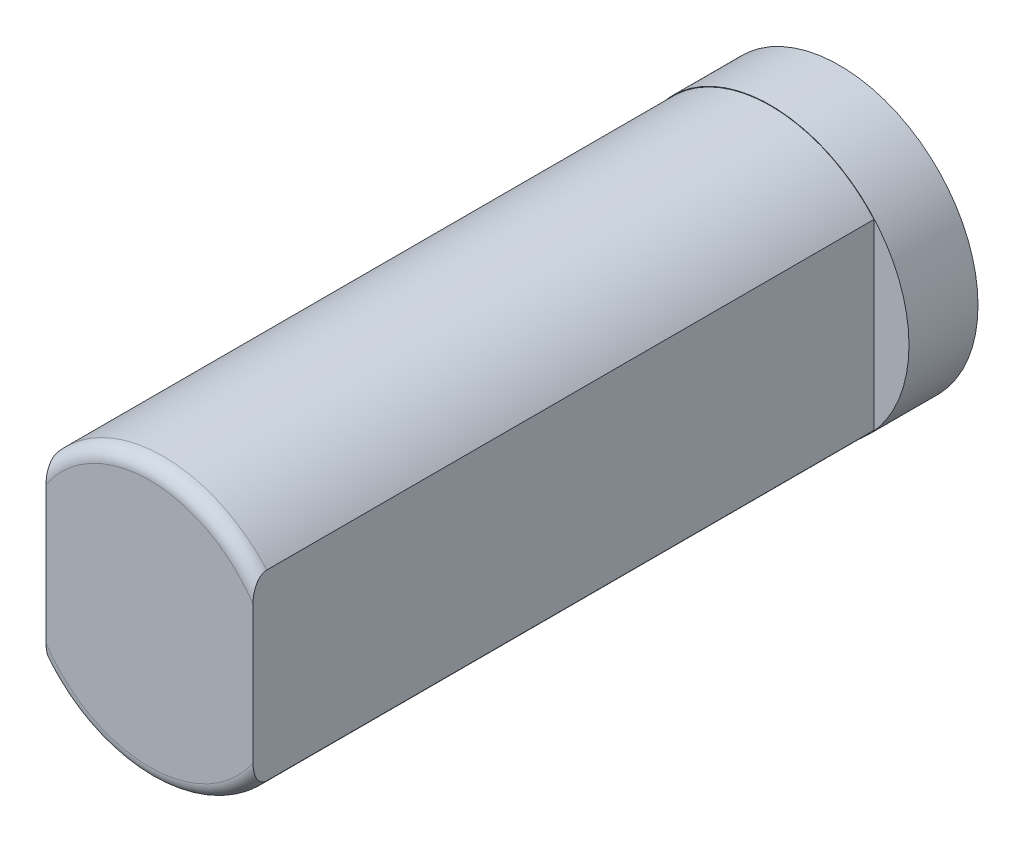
from build123d import *

# Parameters (mm, degrees)
BOSS_EXTRUDE1_DEPTH = 10
FILLET1_R           = 0.2
SKETCH2_R           = 2.007162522
BOSS_EXTRUDE2_DEPTH = 1


with BuildPart() as part:
    # Sketch1 → Boss-Extrude1 (new body)
    with BuildSketch(Plane.XY):
        with BuildLine():
            Line((-1.5, 1.322875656), (-1.5, -1.322875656))
            ThreePointArc((-1.5, -1.322875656), (0, -2), (1.5, -1.322875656))
            Line((1.5, -1.322875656), (1.5, 1.322875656))
            ThreePointArc((1.5, 1.322875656), (0, 2), (-1.5, 1.322875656))
        make_face()
    extrude(amount=BOSS_EXTRUDE1_DEPTH)

    # Fillet1
    fillet1_edges = [part.edges().sort_by_distance(p)[0] for p in [
        (0, -2, 10),
        (0, 2, 10),
    ]]
    fillet(fillet1_edges, radius=FILLET1_R)

    # Sketch2 → Boss-Extrude2 (add)
    with BuildSketch(Plane(origin=(0, 0, 0), x_dir=(-1, 0, 0), z_dir=(0, 0, -1))):
        Circle(SKETCH2_R)
    extrude(amount=-BOSS_EXTRUDE2_DEPTH)


solid = part.part
